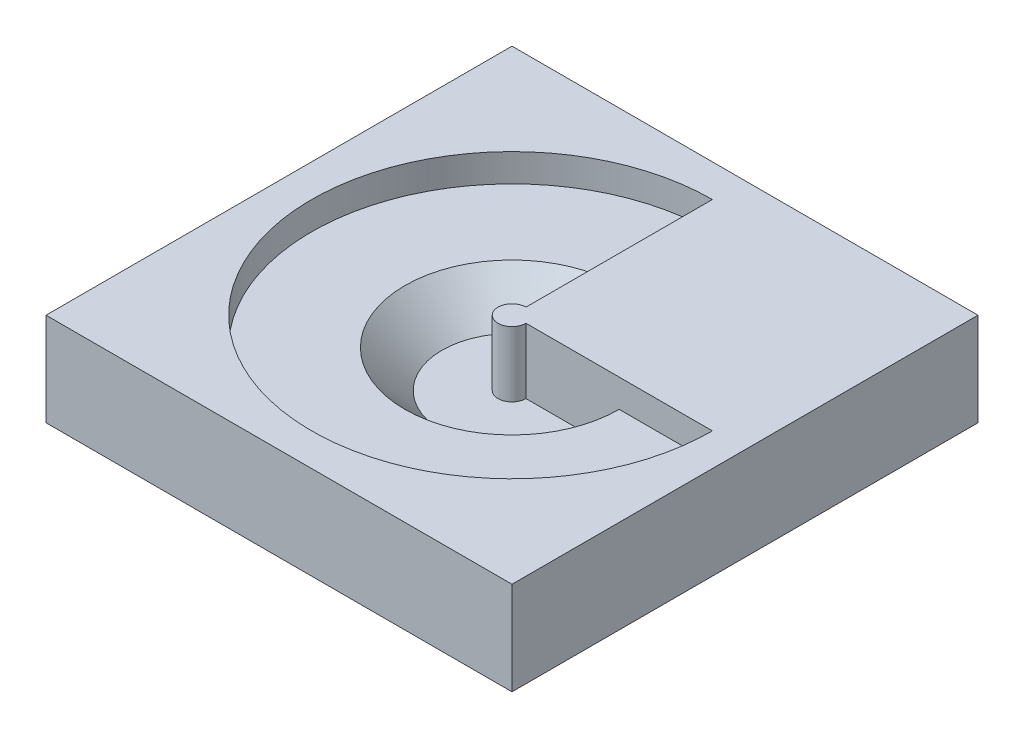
ISO-10303-21;
HEADER;
FILE_DESCRIPTION(('STEP AP214'),'2;1');
FILE_NAME('part.step','',(''),(''),'','','');
FILE_SCHEMA(('AUTOMOTIVE_DESIGN { 1 0 10303 214 1 1 1 1 }'));
ENDSEC;
DATA;
#1=APPLICATION_CONTEXT('core data for automotive mechanical design processes');
#2=APPLICATION_PROTOCOL_DEFINITION('international standard','automotive_design',2000,#1);
#3=PRODUCT_CONTEXT('',#1,'mechanical');
#4=PRODUCT('Part','Part','',(#3));
#5=PRODUCT_RELATED_PRODUCT_CATEGORY('part','',(#4));
#6=PRODUCT_DEFINITION_FORMATION('','',#4);
#7=PRODUCT_DEFINITION_CONTEXT('part definition',#1,'design');
#8=PRODUCT_DEFINITION('design','',#6,#7);
#9=PRODUCT_DEFINITION_SHAPE('','',#8);
#10=(LENGTH_UNIT() NAMED_UNIT(*) SI_UNIT(.MILLI.,.METRE.));
#11=(NAMED_UNIT(*) PLANE_ANGLE_UNIT() SI_UNIT($,.RADIAN.));
#12=(NAMED_UNIT(*) SI_UNIT($,.STERADIAN.) SOLID_ANGLE_UNIT());
#13=UNCERTAINTY_MEASURE_WITH_UNIT(LENGTH_MEASURE(1.E-05),#10,'distance_accuracy_value','');
#14=(GEOMETRIC_REPRESENTATION_CONTEXT(3) GLOBAL_UNCERTAINTY_ASSIGNED_CONTEXT((#13)) GLOBAL_UNIT_ASSIGNED_CONTEXT((#10,
#11,#12)) REPRESENTATION_CONTEXT('',''));
#15=CARTESIAN_POINT('',(0.,0.,0.));
#16=DIRECTION('',(0.,0.,1.));
#17=DIRECTION('',(1.,0.,0.));
#18=AXIS2_PLACEMENT_3D('',#15,#16,#17);
#19=CARTESIAN_POINT('',(-50.,10.,50.));
#20=DIRECTION('',(0.,1.,0.));
#21=DIRECTION('',(0.,0.,1.));
#22=AXIS2_PLACEMENT_3D('',#19,#20,#21);
#23=PLANE('',#22);
#24=DIRECTION('',(0.,0.,1.));
#25=VECTOR('',#24,1.);
#26=CARTESIAN_POINT('',(-50.,10.,-50.));
#27=LINE('',#26,#25);
#28=CARTESIAN_POINT('',(-50.,10.,-50.));
#29=VERTEX_POINT('',#28);
#30=CARTESIAN_POINT('',(-50.,10.,50.));
#31=VERTEX_POINT('',#30);
#32=EDGE_CURVE('E175',#29,#31,#27,.T.);
#33=ORIENTED_EDGE('',*,*,#32,.T.);
#34=DIRECTION('',(1.,0.,0.));
#35=VECTOR('',#34,1.);
#36=CARTESIAN_POINT('',(-50.,10.,50.));
#37=LINE('',#36,#35);
#38=CARTESIAN_POINT('',(50.,10.,50.));
#39=VERTEX_POINT('',#38);
#40=EDGE_CURVE('E177',#31,#39,#37,.T.);
#41=ORIENTED_EDGE('',*,*,#40,.T.);
#42=DIRECTION('',(0.,0.,-1.));
#43=VECTOR('',#42,1.);
#44=CARTESIAN_POINT('',(50.,10.,-50.));
#45=LINE('',#44,#43);
#46=CARTESIAN_POINT('',(50.,10.,-50.));
#47=VERTEX_POINT('',#46);
#48=EDGE_CURVE('E179',#39,#47,#45,.T.);
#49=ORIENTED_EDGE('',*,*,#48,.T.);
#50=DIRECTION('',(-1.,0.,0.));
#51=VECTOR('',#50,1.);
#52=CARTESIAN_POINT('',(-50.,10.,-50.));
#53=LINE('',#52,#51);
#54=EDGE_CURVE('E56',#47,#29,#53,.T.);
#55=ORIENTED_EDGE('',*,*,#54,.T.);
#56=EDGE_LOOP('',(#33,#41,#49,#55));
#57=FACE_BOUND('',#56,.T.);
#58=CARTESIAN_POINT('',(0.,10.,0.));
#59=DIRECTION('',(0.,1.,0.));
#60=DIRECTION('',(0.,0.,1.));
#61=AXIS2_PLACEMENT_3D('',#58,#59,#60);
#62=CIRCLE('',#61,43.);
#63=CARTESIAN_POINT('',(1.50133784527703E-13,10.,-43.));
#64=VERTEX_POINT('',#63);
#65=CARTESIAN_POINT('',(43.,10.,-2.95532316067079E-13));
#66=VERTEX_POINT('',#65);
#67=EDGE_CURVE('E126',#64,#66,#62,.T.);
#68=ORIENTED_EDGE('',*,*,#67,.F.);
#69=DIRECTION('',(0.,0.,-1.));
#70=VECTOR('',#69,1.);
#71=CARTESIAN_POINT('',(0.,10.,-3.));
#72=LINE('',#71,#70);
#73=CARTESIAN_POINT('',(0.,10.,-3.));
#74=VERTEX_POINT('',#73);
#75=EDGE_CURVE('E155',#74,#64,#72,.T.);
#76=ORIENTED_EDGE('',*,*,#75,.F.);
#77=CARTESIAN_POINT('',(0.,10.,0.));
#78=DIRECTION('',(0.,1.,0.));
#79=DIRECTION('',(0.,0.,1.));
#80=AXIS2_PLACEMENT_3D('',#77,#78,#79);
#81=CIRCLE('',#80,3.);
#82=CARTESIAN_POINT('',(3.,10.,0.));
#83=VERTEX_POINT('',#82);
#84=EDGE_CURVE('E159',#74,#83,#81,.T.);
#85=ORIENTED_EDGE('',*,*,#84,.T.);
#86=DIRECTION('',(1.,0.,0.));
#87=VECTOR('',#86,1.);
#88=CARTESIAN_POINT('',(3.,10.,0.));
#89=LINE('',#88,#87);
#90=EDGE_CURVE('E141',#83,#66,#89,.T.);
#91=ORIENTED_EDGE('',*,*,#90,.T.);
#92=EDGE_LOOP('',(#68,#76,#85,#91));
#93=FACE_BOUND('',#92,.T.);
#94=ADVANCED_FACE('F33',(#57,#93),#23,.T.);
#95=CARTESIAN_POINT('',(-50.,10.,-50.));
#96=DIRECTION('',(1.,0.,0.));
#97=DIRECTION('',(0.,0.,-1.));
#98=AXIS2_PLACEMENT_3D('',#95,#96,#97);
#99=PLANE('',#98);
#100=DIRECTION('',(0.,0.,1.));
#101=VECTOR('',#100,1.);
#102=CARTESIAN_POINT('',(-50.,-10.,-50.));
#103=LINE('',#102,#101);
#104=CARTESIAN_POINT('',(-50.,-10.,-50.));
#105=VERTEX_POINT('',#104);
#106=CARTESIAN_POINT('',(-50.,-10.,50.));
#107=VERTEX_POINT('',#106);
#108=EDGE_CURVE('E121',#105,#107,#103,.T.);
#109=ORIENTED_EDGE('',*,*,#108,.T.);
#110=DIRECTION('',(0.,-1.,0.));
#111=VECTOR('',#110,1.);
#112=CARTESIAN_POINT('',(-50.,10.,50.));
#113=LINE('',#112,#111);
#114=EDGE_CURVE('E11',#31,#107,#113,.T.);
#115=ORIENTED_EDGE('',*,*,#114,.F.);
#116=ORIENTED_EDGE('',*,*,#32,.F.);
#117=DIRECTION('',(0.,-1.,0.));
#118=VECTOR('',#117,1.);
#119=CARTESIAN_POINT('',(-50.,10.,-50.));
#120=LINE('',#119,#118);
#121=EDGE_CURVE('E182',#29,#105,#120,.T.);
#122=ORIENTED_EDGE('',*,*,#121,.T.);
#123=EDGE_LOOP('',(#109,#115,#116,#122));
#124=FACE_BOUND('',#123,.T.);
#125=ADVANCED_FACE('F35',(#124),#99,.F.);
#126=CARTESIAN_POINT('',(-50.,10.,50.));
#127=DIRECTION('',(0.,0.,-1.));
#128=DIRECTION('',(-1.,0.,0.));
#129=AXIS2_PLACEMENT_3D('',#126,#127,#128);
#130=PLANE('',#129);
#131=DIRECTION('',(1.,0.,0.));
#132=VECTOR('',#131,1.);
#133=CARTESIAN_POINT('',(-50.,-10.,50.));
#134=LINE('',#133,#132);
#135=CARTESIAN_POINT('',(50.,-10.,50.));
#136=VERTEX_POINT('',#135);
#137=EDGE_CURVE('E169',#107,#136,#134,.T.);
#138=ORIENTED_EDGE('',*,*,#137,.T.);
#139=DIRECTION('',(0.,-1.,0.));
#140=VECTOR('',#139,1.);
#141=CARTESIAN_POINT('',(50.,10.,50.));
#142=LINE('',#141,#140);
#143=EDGE_CURVE('E41',#39,#136,#142,.T.);
#144=ORIENTED_EDGE('',*,*,#143,.F.);
#145=ORIENTED_EDGE('',*,*,#40,.F.);
#146=ORIENTED_EDGE('',*,*,#114,.T.);
#147=EDGE_LOOP('',(#138,#144,#145,#146));
#148=FACE_BOUND('',#147,.T.);
#149=ADVANCED_FACE('F205',(#148),#130,.F.);
#150=CARTESIAN_POINT('',(50.,10.,-50.));
#151=DIRECTION('',(-1.,0.,0.));
#152=DIRECTION('',(0.,0.,1.));
#153=AXIS2_PLACEMENT_3D('',#150,#151,#152);
#154=PLANE('',#153);
#155=DIRECTION('',(0.,0.,-1.));
#156=VECTOR('',#155,1.);
#157=CARTESIAN_POINT('',(50.,-10.,-50.));
#158=LINE('',#157,#156);
#159=CARTESIAN_POINT('',(50.,-10.,-50.));
#160=VERTEX_POINT('',#159);
#161=EDGE_CURVE('E171',#136,#160,#158,.T.);
#162=ORIENTED_EDGE('',*,*,#161,.T.);
#163=DIRECTION('',(0.,-1.,0.));
#164=VECTOR('',#163,1.);
#165=CARTESIAN_POINT('',(50.,10.,-50.));
#166=LINE('',#165,#164);
#167=EDGE_CURVE('E185',#47,#160,#166,.T.);
#168=ORIENTED_EDGE('',*,*,#167,.F.);
#169=ORIENTED_EDGE('',*,*,#48,.F.);
#170=ORIENTED_EDGE('',*,*,#143,.T.);
#171=EDGE_LOOP('',(#162,#168,#169,#170));
#172=FACE_BOUND('',#171,.T.);
#173=ADVANCED_FACE('F192',(#172),#154,.F.);
#174=CARTESIAN_POINT('',(-50.,10.,-50.));
#175=DIRECTION('',(0.,0.,1.));
#176=DIRECTION('',(1.,0.,0.));
#177=AXIS2_PLACEMENT_3D('',#174,#175,#176);
#178=PLANE('',#177);
#179=DIRECTION('',(-1.,0.,0.));
#180=VECTOR('',#179,1.);
#181=CARTESIAN_POINT('',(-50.,-10.,-50.));
#182=LINE('',#181,#180);
#183=EDGE_CURVE('E173',#160,#105,#182,.T.);
#184=ORIENTED_EDGE('',*,*,#183,.T.);
#185=ORIENTED_EDGE('',*,*,#121,.F.);
#186=ORIENTED_EDGE('',*,*,#54,.F.);
#187=ORIENTED_EDGE('',*,*,#167,.T.);
#188=EDGE_LOOP('',(#184,#185,#186,#187));
#189=FACE_BOUND('',#188,.T.);
#190=ADVANCED_FACE('F200',(#189),#178,.F.);
#191=CARTESIAN_POINT('',(-50.,-10.,50.));
#192=DIRECTION('',(0.,1.,0.));
#193=DIRECTION('',(0.,0.,1.));
#194=AXIS2_PLACEMENT_3D('',#191,#192,#193);
#195=PLANE('',#194);
#196=ORIENTED_EDGE('',*,*,#108,.F.);
#197=ORIENTED_EDGE('',*,*,#183,.F.);
#198=ORIENTED_EDGE('',*,*,#161,.F.);
#199=ORIENTED_EDGE('',*,*,#137,.F.);
#200=EDGE_LOOP('',(#196,#197,#198,#199));
#201=FACE_BOUND('',#200,.T.);
#202=ADVANCED_FACE('F198',(#201),#195,.F.);
#203=CARTESIAN_POINT('',(0.,0.,0.));
#204=DIRECTION('',(0.,1.,0.));
#205=DIRECTION('',(0.,0.,1.));
#206=AXIS2_PLACEMENT_3D('',#203,#204,#205);
#207=CYLINDRICAL_SURFACE('',#206,43.);
#208=CARTESIAN_POINT('',(0.,4.,0.));
#209=DIRECTION('',(0.,1.,0.));
#210=DIRECTION('',(0.,0.,1.));
#211=AXIS2_PLACEMENT_3D('',#208,#209,#210);
#212=CIRCLE('',#211,43.);
#213=CARTESIAN_POINT('',(1.50133784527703E-13,4.,-43.));
#214=VERTEX_POINT('',#213);
#215=CARTESIAN_POINT('',(43.,4.,-3.00267569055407E-13));
#216=VERTEX_POINT('',#215);
#217=EDGE_CURVE('E113',#214,#216,#212,.T.);
#218=ORIENTED_EDGE('',*,*,#217,.F.);
#219=DIRECTION('',(0.,-1.,0.));
#220=VECTOR('',#219,1.);
#221=CARTESIAN_POINT('',(1.50133784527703E-13,10.,-43.));
#222=LINE('',#221,#220);
#223=EDGE_CURVE('E143',#64,#214,#222,.T.);
#224=ORIENTED_EDGE('',*,*,#223,.F.);
#225=ORIENTED_EDGE('',*,*,#67,.T.);
#226=DIRECTION('',(0.,-1.,0.));
#227=VECTOR('',#226,1.);
#228=CARTESIAN_POINT('',(43.,10.,-3.00267569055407E-13));
#229=LINE('',#228,#227);
#230=EDGE_CURVE('E48',#66,#216,#229,.T.);
#231=ORIENTED_EDGE('',*,*,#230,.T.);
#232=EDGE_LOOP('',(#218,#224,#225,#231));
#233=FACE_BOUND('',#232,.T.);
#234=ADVANCED_FACE('F124',(#233),#207,.F.);
#235=CARTESIAN_POINT('',(1.50133784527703E-13,4.00000000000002,-43.));
#236=DIRECTION('',(0.,-1.,0.));
#237=DIRECTION('',(0.,0.,-1.));
#238=AXIS2_PLACEMENT_3D('',#235,#236,#237);
#239=PLANE('',#238);
#240=CARTESIAN_POINT('',(0.,4.00000000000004,0.));
#241=DIRECTION('',(0.,1.,0.));
#242=DIRECTION('',(0.,0.,1.));
#243=AXIS2_PLACEMENT_3D('',#240,#241,#242);
#244=CIRCLE('',#243,22.9999999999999);
#245=CARTESIAN_POINT('',(0.,4.00000000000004,-22.9999999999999));
#246=VERTEX_POINT('',#245);
#247=CARTESIAN_POINT('',(22.9999999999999,4.00000000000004,-1.60608234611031E-13));
#248=VERTEX_POINT('',#247);
#249=EDGE_CURVE('E122',#246,#248,#244,.T.);
#250=ORIENTED_EDGE('',*,*,#249,.F.);
#251=DIRECTION('',(0.,0.,1.));
#252=VECTOR('',#251,1.);
#253=CARTESIAN_POINT('',(1.50133784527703E-13,4.,-43.));
#254=LINE('',#253,#252);
#255=EDGE_CURVE('E118',#214,#246,#254,.T.);
#256=ORIENTED_EDGE('',*,*,#255,.F.);
#257=ORIENTED_EDGE('',*,*,#217,.T.);
#258=DIRECTION('',(-1.,0.,0.));
#259=VECTOR('',#258,1.);
#260=CARTESIAN_POINT('',(43.,4.,-3.00267569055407E-13));
#261=LINE('',#260,#259);
#262=EDGE_CURVE('E115',#216,#248,#261,.T.);
#263=ORIENTED_EDGE('',*,*,#262,.T.);
#264=EDGE_LOOP('',(#250,#256,#257,#263));
#265=FACE_BOUND('',#264,.T.);
#266=ADVANCED_FACE('F114',(#265),#239,.F.);
#267=CARTESIAN_POINT('',(0.,4.00000000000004,0.));
#268=DIRECTION('',(0.,1.,0.));
#269=DIRECTION('',(0.,0.,1.));
#270=AXIS2_PLACEMENT_3D('',#267,#268,#269);
#271=CONICAL_SURFACE('',#270,22.9999999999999,0.785398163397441);
#272=CARTESIAN_POINT('',(0.,-4.,0.));
#273=DIRECTION('',(0.,1.,0.));
#274=DIRECTION('',(0.,0.,1.));
#275=AXIS2_PLACEMENT_3D('',#272,#273,#274);
#276=CIRCLE('',#275,15.);
#277=CARTESIAN_POINT('',(0.,-4.,-15.));
#278=VERTEX_POINT('',#277);
#279=CARTESIAN_POINT('',(15.,-4.,-1.04744500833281E-13));
#280=VERTEX_POINT('',#279);
#281=EDGE_CURVE('E164',#278,#280,#276,.T.);
#282=ORIENTED_EDGE('',*,*,#281,.F.);
#283=DIRECTION('',(0.,-0.707106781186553,0.707106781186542));
#284=VECTOR('',#283,1.);
#285=CARTESIAN_POINT('',(0.,4.00000000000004,-22.9999999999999));
#286=LINE('',#285,#284);
#287=EDGE_CURVE('E146',#246,#278,#286,.T.);
#288=ORIENTED_EDGE('',*,*,#287,.F.);
#289=ORIENTED_EDGE('',*,*,#249,.T.);
#290=DIRECTION('',(-0.707106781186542,-0.707106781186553,0.));
#291=VECTOR('',#290,1.);
#292=CARTESIAN_POINT('',(22.9999999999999,4.00000000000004,-1.60608234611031E-13));
#293=LINE('',#292,#291);
#294=EDGE_CURVE('E132',#248,#280,#293,.T.);
#295=ORIENTED_EDGE('',*,*,#294,.T.);
#296=EDGE_LOOP('',(#282,#288,#289,#295));
#297=FACE_BOUND('',#296,.T.);
#298=ADVANCED_FACE('F230',(#297),#271,.F.);
#299=CARTESIAN_POINT('',(0.,-4.,-15.));
#300=DIRECTION('',(0.,-1.,0.));
#301=DIRECTION('',(0.,0.,-1.));
#302=AXIS2_PLACEMENT_3D('',#299,#300,#301);
#303=PLANE('',#302);
#304=CARTESIAN_POINT('',(0.,-4.,0.));
#305=DIRECTION('',(0.,1.,0.));
#306=DIRECTION('',(0.,0.,1.));
#307=AXIS2_PLACEMENT_3D('',#304,#305,#306);
#308=CIRCLE('',#307,3.);
#309=CARTESIAN_POINT('',(0.,-4.,-3.));
#310=VERTEX_POINT('',#309);
#311=CARTESIAN_POINT('',(3.,-4.,0.));
#312=VERTEX_POINT('',#311);
#313=EDGE_CURVE('E162',#310,#312,#308,.T.);
#314=ORIENTED_EDGE('',*,*,#313,.F.);
#315=DIRECTION('',(0.,0.,1.));
#316=VECTOR('',#315,1.);
#317=CARTESIAN_POINT('',(0.,-4.,-15.));
#318=LINE('',#317,#316);
#319=EDGE_CURVE('E149',#278,#310,#318,.T.);
#320=ORIENTED_EDGE('',*,*,#319,.F.);
#321=ORIENTED_EDGE('',*,*,#281,.T.);
#322=DIRECTION('',(-1.,0.,0.));
#323=VECTOR('',#322,1.);
#324=CARTESIAN_POINT('',(15.,-4.,-1.04744500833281E-13));
#325=LINE('',#324,#323);
#326=EDGE_CURVE('E134',#280,#312,#325,.T.);
#327=ORIENTED_EDGE('',*,*,#326,.T.);
#328=EDGE_LOOP('',(#314,#320,#321,#327));
#329=FACE_BOUND('',#328,.T.);
#330=ADVANCED_FACE('F238',(#329),#303,.F.);
#331=CARTESIAN_POINT('',(0.,0.,0.));
#332=DIRECTION('',(0.,1.,0.));
#333=DIRECTION('',(0.,0.,1.));
#334=AXIS2_PLACEMENT_3D('',#331,#332,#333);
#335=CYLINDRICAL_SURFACE('',#334,3.);
#336=ORIENTED_EDGE('',*,*,#84,.F.);
#337=DIRECTION('',(0.,1.,0.));
#338=VECTOR('',#337,1.);
#339=CARTESIAN_POINT('',(0.,10.,-3.));
#340=LINE('',#339,#338);
#341=EDGE_CURVE('E152',#310,#74,#340,.T.);
#342=ORIENTED_EDGE('',*,*,#341,.F.);
#343=ORIENTED_EDGE('',*,*,#313,.T.);
#344=DIRECTION('',(0.,1.,0.));
#345=VECTOR('',#344,1.);
#346=CARTESIAN_POINT('',(3.,10.,0.));
#347=LINE('',#346,#345);
#348=EDGE_CURVE('E139',#312,#83,#347,.T.);
#349=ORIENTED_EDGE('',*,*,#348,.T.);
#350=EDGE_LOOP('',(#336,#342,#343,#349));
#351=FACE_BOUND('',#350,.T.);
#352=ADVANCED_FACE('F235',(#351),#335,.T.);
#353=CARTESIAN_POINT('',(1.50133784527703E-13,4.,-43.));
#354=DIRECTION('',(-1.,0.,0.));
#355=DIRECTION('',(0.,0.,1.));
#356=AXIS2_PLACEMENT_3D('',#353,#354,#355);
#357=PLANE('',#356);
#358=ORIENTED_EDGE('',*,*,#223,.T.);
#359=ORIENTED_EDGE('',*,*,#255,.T.);
#360=ORIENTED_EDGE('',*,*,#287,.T.);
#361=ORIENTED_EDGE('',*,*,#319,.T.);
#362=ORIENTED_EDGE('',*,*,#341,.T.);
#363=ORIENTED_EDGE('',*,*,#75,.T.);
#364=EDGE_LOOP('',(#358,#359,#360,#361,#362,#363));
#365=FACE_BOUND('',#364,.T.);
#366=ADVANCED_FACE('F233',(#365),#357,.T.);
#367=CARTESIAN_POINT('',(43.,4.,-3.00267569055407E-13));
#368=DIRECTION('',(0.,0.,-1.));
#369=DIRECTION('',(-1.,0.,0.));
#370=AXIS2_PLACEMENT_3D('',#367,#368,#369);
#371=PLANE('',#370);
#372=ORIENTED_EDGE('',*,*,#230,.F.);
#373=ORIENTED_EDGE('',*,*,#90,.F.);
#374=ORIENTED_EDGE('',*,*,#348,.F.);
#375=ORIENTED_EDGE('',*,*,#326,.F.);
#376=ORIENTED_EDGE('',*,*,#294,.F.);
#377=ORIENTED_EDGE('',*,*,#262,.F.);
#378=EDGE_LOOP('',(#372,#373,#374,#375,#376,#377));
#379=FACE_BOUND('',#378,.T.);
#380=ADVANCED_FACE('F129',(#379),#371,.F.);
#381=CLOSED_SHELL('',(#94,#125,#149,#173,#190,#202,#234,#266,#298,#330,#352,#366,#380));
#382=MANIFOLD_SOLID_BREP('B2',#381);
#383=ADVANCED_BREP_SHAPE_REPRESENTATION('',(#18,#382),#14);
#384=SHAPE_DEFINITION_REPRESENTATION(#9,#383);
ENDSEC;
END-ISO-10303-21;
